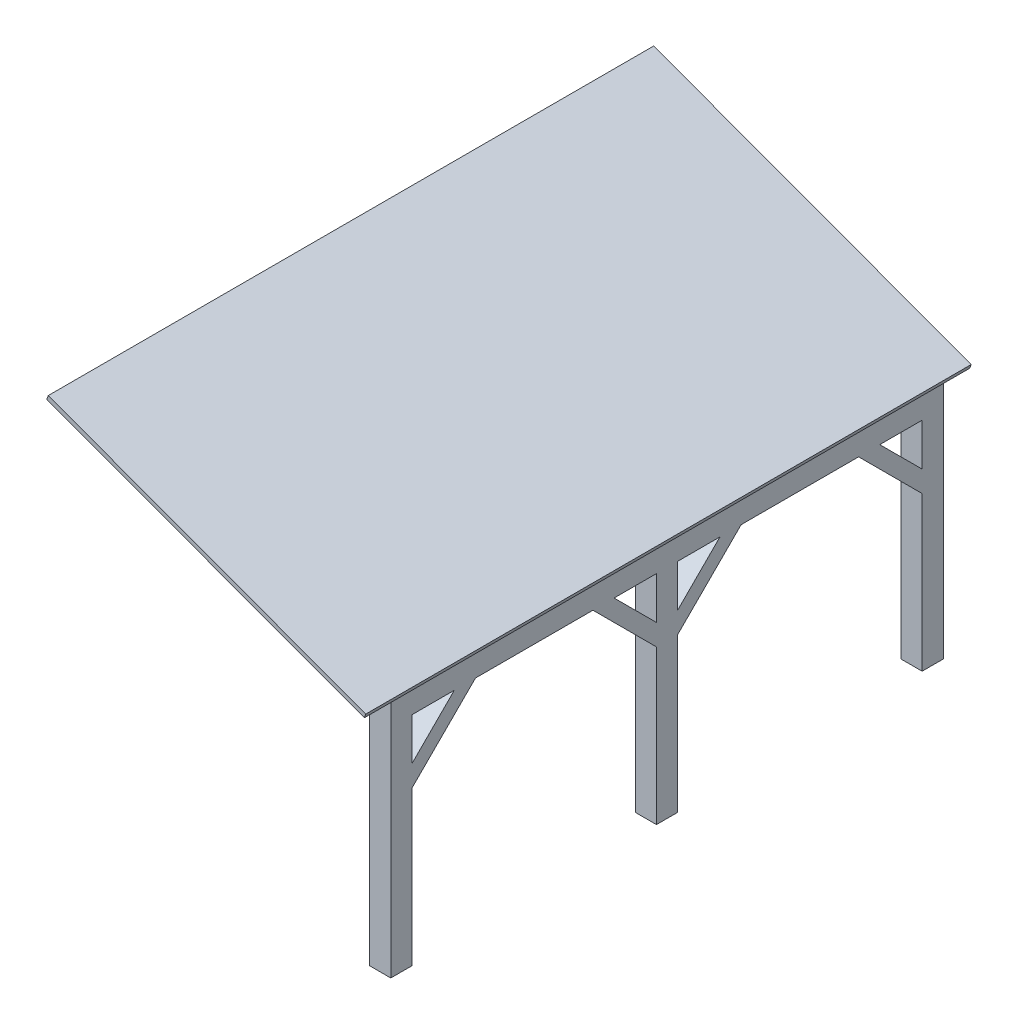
ISO-10303-21;
HEADER;
FILE_DESCRIPTION(('STEP AP214'),'2;1');
FILE_NAME('part.step','',(''),(''),'','','');
FILE_SCHEMA(('AUTOMOTIVE_DESIGN { 1 0 10303 214 1 1 1 1 }'));
ENDSEC;
DATA;
#1=APPLICATION_CONTEXT('core data for automotive mechanical design processes');
#2=APPLICATION_PROTOCOL_DEFINITION('international standard','automotive_design',2000,#1);
#3=PRODUCT_CONTEXT('',#1,'mechanical');
#4=PRODUCT('Part','Part','',(#3));
#5=PRODUCT_RELATED_PRODUCT_CATEGORY('part','',(#4));
#6=PRODUCT_DEFINITION_FORMATION('','',#4);
#7=PRODUCT_DEFINITION_CONTEXT('part definition',#1,'design');
#8=PRODUCT_DEFINITION('design','',#6,#7);
#9=PRODUCT_DEFINITION_SHAPE('','',#8);
#10=(LENGTH_UNIT() NAMED_UNIT(*) SI_UNIT(.MILLI.,.METRE.));
#11=(NAMED_UNIT(*) PLANE_ANGLE_UNIT() SI_UNIT($,.RADIAN.));
#12=(NAMED_UNIT(*) SI_UNIT($,.STERADIAN.) SOLID_ANGLE_UNIT());
#13=UNCERTAINTY_MEASURE_WITH_UNIT(LENGTH_MEASURE(1.E-05),#10,'distance_accuracy_value','');
#14=(GEOMETRIC_REPRESENTATION_CONTEXT(3) GLOBAL_UNCERTAINTY_ASSIGNED_CONTEXT((#13)) GLOBAL_UNIT_ASSIGNED_CONTEXT((#10,
#11,#12)) REPRESENTATION_CONTEXT('',''));
#15=CARTESIAN_POINT('',(0.,0.,0.));
#16=DIRECTION('',(0.,0.,1.));
#17=DIRECTION('',(1.,0.,0.));
#18=AXIS2_PLACEMENT_3D('',#15,#16,#17);
#19=CARTESIAN_POINT('',(0.,0.,26.1));
#20=DIRECTION('',(0.,0.,-1.));
#21=DIRECTION('',(-1.,0.,0.));
#22=AXIS2_PLACEMENT_3D('',#19,#20,#21);
#23=PLANE('',#22);
#24=DIRECTION('',(0.938268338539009,-0.345908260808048,0.));
#25=VECTOR('',#24,1.);
#26=CARTESIAN_POINT('',(15.,11.27,26.1));
#27=LINE('',#26,#25);
#28=CARTESIAN_POINT('',(0.,16.8,26.1));
#29=VERTEX_POINT('',#28);
#30=CARTESIAN_POINT('',(15.,11.27,26.1));
#31=VERTEX_POINT('',#30);
#32=EDGE_CURVE('E289',#29,#31,#27,.T.);
#33=ORIENTED_EDGE('',*,*,#32,.F.);
#34=DIRECTION('',(0.,-1.,0.));
#35=VECTOR('',#34,1.);
#36=CARTESIAN_POINT('',(0.,0.,26.1));
#37=LINE('',#36,#35);
#38=CARTESIAN_POINT('',(0.,15.7354198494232,26.1));
#39=VERTEX_POINT('',#38);
#40=EDGE_CURVE('E534',#29,#39,#37,.T.);
#41=ORIENTED_EDGE('',*,*,#40,.T.);
#42=DIRECTION('',(-0.937898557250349,0.346909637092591,0.));
#43=VECTOR('',#42,1.);
#44=CARTESIAN_POINT('',(0.,15.7354198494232,26.1));
#45=LINE('',#44,#43);
#46=CARTESIAN_POINT('',(1.,15.3655401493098,26.1));
#47=VERTEX_POINT('',#46);
#48=EDGE_CURVE('E489',#47,#39,#45,.T.);
#49=ORIENTED_EDGE('',*,*,#48,.F.);
#50=DIRECTION('',(-0.938268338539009,0.345908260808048,0.));
#51=VECTOR('',#50,1.);
#52=CARTESIAN_POINT('',(5.10661186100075,13.8515692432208,26.1));
#53=LINE('',#52,#51);
#54=CARTESIAN_POINT('',(14.,10.5728734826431,26.1));
#55=VERTEX_POINT('',#54);
#56=EDGE_CURVE('E524',#55,#47,#53,.T.);
#57=ORIENTED_EDGE('',*,*,#56,.F.);
#58=DIRECTION('',(0.,1.,0.));
#59=VECTOR('',#58,1.);
#60=CARTESIAN_POINT('',(14.,0.,26.1));
#61=LINE('',#60,#59);
#62=CARTESIAN_POINT('',(14.,0.,26.1));
#63=VERTEX_POINT('',#62);
#64=EDGE_CURVE('E516',#63,#55,#61,.T.);
#65=ORIENTED_EDGE('',*,*,#64,.F.);
#66=DIRECTION('',(1.,0.,0.));
#67=VECTOR('',#66,1.);
#68=CARTESIAN_POINT('',(15.,0.,26.1));
#69=LINE('',#68,#67);
#70=CARTESIAN_POINT('',(15.,0.,26.1));
#71=VERTEX_POINT('',#70);
#72=EDGE_CURVE('E528',#63,#71,#69,.T.);
#73=ORIENTED_EDGE('',*,*,#72,.T.);
#74=DIRECTION('',(0.,1.,0.));
#75=VECTOR('',#74,1.);
#76=CARTESIAN_POINT('',(15.,11.27,26.1));
#77=LINE('',#76,#75);
#78=EDGE_CURVE('E530',#71,#31,#77,.T.);
#79=ORIENTED_EDGE('',*,*,#78,.T.);
#80=EDGE_LOOP('',(#33,#41,#49,#57,#65,#73,#79));
#81=FACE_BOUND('',#80,.T.);
#82=ADVANCED_FACE('F31',(#81),#23,.F.);
#83=CARTESIAN_POINT('',(15.,0.,26.1));
#84=DIRECTION('',(0.,1.,0.));
#85=DIRECTION('',(-1.,0.,0.));
#86=AXIS2_PLACEMENT_3D('',#83,#84,#85);
#87=PLANE('',#86);
#88=DIRECTION('',(0.,0.,-1.));
#89=VECTOR('',#88,1.);
#90=CARTESIAN_POINT('',(14.,0.,26.1));
#91=LINE('',#90,#89);
#92=CARTESIAN_POINT('',(14.,0.,13.55));
#93=VERTEX_POINT('',#92);
#94=CARTESIAN_POINT('',(14.,0.,12.55));
#95=VERTEX_POINT('',#94);
#96=EDGE_CURVE('E517',#93,#95,#91,.T.);
#97=ORIENTED_EDGE('',*,*,#96,.T.);
#98=DIRECTION('',(1.,0.,0.));
#99=VECTOR('',#98,1.);
#100=CARTESIAN_POINT('',(14.,0.,12.55));
#101=LINE('',#100,#99);
#102=CARTESIAN_POINT('',(15.,0.,12.55));
#103=VERTEX_POINT('',#102);
#104=EDGE_CURVE('E444',#95,#103,#101,.T.);
#105=ORIENTED_EDGE('',*,*,#104,.T.);
#106=DIRECTION('',(0.,0.,-1.));
#107=VECTOR('',#106,1.);
#108=CARTESIAN_POINT('',(15.,0.,26.1));
#109=LINE('',#108,#107);
#110=CARTESIAN_POINT('',(15.,0.,13.55));
#111=VERTEX_POINT('',#110);
#112=EDGE_CURVE('E39',#111,#103,#109,.T.);
#113=ORIENTED_EDGE('',*,*,#112,.F.);
#114=DIRECTION('',(1.,0.,0.));
#115=VECTOR('',#114,1.);
#116=CARTESIAN_POINT('',(14.,0.,13.55));
#117=LINE('',#116,#115);
#118=EDGE_CURVE('E473',#93,#111,#117,.T.);
#119=ORIENTED_EDGE('',*,*,#118,.F.);
#120=EDGE_LOOP('',(#97,#105,#113,#119));
#121=FACE_BOUND('',#120,.T.);
#122=ADVANCED_FACE('F563',(#121),#87,.F.);
#123=CARTESIAN_POINT('',(14.,0.,25.1));
#124=VERTEX_POINT('',#123);
#125=EDGE_CURVE('E513',#63,#124,#91,.T.);
#126=ORIENTED_EDGE('',*,*,#125,.T.);
#127=DIRECTION('',(1.,0.,0.));
#128=VECTOR('',#127,1.);
#129=CARTESIAN_POINT('',(14.,0.,25.1));
#130=LINE('',#129,#128);
#131=CARTESIAN_POINT('',(15.,0.,25.1));
#132=VERTEX_POINT('',#131);
#133=EDGE_CURVE('E486',#124,#132,#130,.T.);
#134=ORIENTED_EDGE('',*,*,#133,.T.);
#135=EDGE_CURVE('E11',#71,#132,#109,.T.);
#136=ORIENTED_EDGE('',*,*,#135,.F.);
#137=ORIENTED_EDGE('',*,*,#72,.F.);
#138=EDGE_LOOP('',(#126,#134,#136,#137));
#139=FACE_BOUND('',#138,.T.);
#140=ADVANCED_FACE('F639',(#139),#87,.F.);
#141=CARTESIAN_POINT('',(15.,0.,0.999999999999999));
#142=VERTEX_POINT('',#141);
#143=CARTESIAN_POINT('',(15.,0.,0.));
#144=VERTEX_POINT('',#143);
#145=EDGE_CURVE('E40',#142,#144,#109,.T.);
#146=ORIENTED_EDGE('',*,*,#145,.F.);
#147=DIRECTION('',(1.,0.,0.));
#148=VECTOR('',#147,1.);
#149=CARTESIAN_POINT('',(14.,0.,0.999999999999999));
#150=LINE('',#149,#148);
#151=CARTESIAN_POINT('',(14.,0.,0.999999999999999));
#152=VERTEX_POINT('',#151);
#153=EDGE_CURVE('E431',#152,#142,#150,.T.);
#154=ORIENTED_EDGE('',*,*,#153,.F.);
#155=CARTESIAN_POINT('',(14.,0.,0.));
#156=VERTEX_POINT('',#155);
#157=EDGE_CURVE('E512',#152,#156,#91,.T.);
#158=ORIENTED_EDGE('',*,*,#157,.T.);
#159=DIRECTION('',(1.,0.,0.));
#160=VECTOR('',#159,1.);
#161=CARTESIAN_POINT('',(15.,0.,0.));
#162=LINE('',#161,#160);
#163=EDGE_CURVE('E520',#156,#144,#162,.T.);
#164=ORIENTED_EDGE('',*,*,#163,.T.);
#165=EDGE_LOOP('',(#146,#154,#158,#164));
#166=FACE_BOUND('',#165,.T.);
#167=ADVANCED_FACE('F33',(#166),#87,.F.);
#168=CARTESIAN_POINT('',(15.,11.27,26.1));
#169=DIRECTION('',(-1.,0.,0.));
#170=DIRECTION('',(0.,-1.,0.));
#171=AXIS2_PLACEMENT_3D('',#168,#169,#170);
#172=PLANE('',#171);
#173=DIRECTION('',(0.,0.,1.));
#174=VECTOR('',#173,1.);
#175=CARTESIAN_POINT('',(15.,10.27,12.55));
#176=LINE('',#175,#174);
#177=CARTESIAN_POINT('',(15.,10.27,10.55));
#178=VERTEX_POINT('',#177);
#179=CARTESIAN_POINT('',(15.,10.27,12.55));
#180=VERTEX_POINT('',#179);
#181=EDGE_CURVE('E332',#178,#180,#176,.T.);
#182=ORIENTED_EDGE('',*,*,#181,.F.);
#183=DIRECTION('',(0.,0.707106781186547,-0.707106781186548));
#184=VECTOR('',#183,1.);
#185=CARTESIAN_POINT('',(15.,10.27,10.55));
#186=LINE('',#185,#184);
#187=CARTESIAN_POINT('',(15.,8.27,12.55));
#188=VERTEX_POINT('',#187);
#189=EDGE_CURVE('E47',#188,#178,#186,.T.);
#190=ORIENTED_EDGE('',*,*,#189,.F.);
#191=DIRECTION('',(0.,-1.,0.));
#192=VECTOR('',#191,1.);
#193=CARTESIAN_POINT('',(15.,8.27,12.55));
#194=LINE('',#193,#192);
#195=EDGE_CURVE('E326',#180,#188,#194,.T.);
#196=ORIENTED_EDGE('',*,*,#195,.F.);
#197=EDGE_LOOP('',(#182,#190,#196));
#198=FACE_BOUND('',#197,.T.);
#199=DIRECTION('',(0.,1.,0.));
#200=VECTOR('',#199,1.);
#201=CARTESIAN_POINT('',(15.,10.27,13.55));
#202=LINE('',#201,#200);
#203=CARTESIAN_POINT('',(15.,8.27,13.55));
#204=VERTEX_POINT('',#203);
#205=CARTESIAN_POINT('',(15.,10.27,13.55));
#206=VERTEX_POINT('',#205);
#207=EDGE_CURVE('E355',#204,#206,#202,.T.);
#208=ORIENTED_EDGE('',*,*,#207,.F.);
#209=DIRECTION('',(0.,-0.707106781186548,-0.707106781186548));
#210=VECTOR('',#209,1.);
#211=CARTESIAN_POINT('',(15.,8.27,13.55));
#212=LINE('',#211,#210);
#213=CARTESIAN_POINT('',(15.,10.27,15.55));
#214=VERTEX_POINT('',#213);
#215=EDGE_CURVE('E339',#214,#204,#212,.T.);
#216=ORIENTED_EDGE('',*,*,#215,.F.);
#217=DIRECTION('',(0.,0.,1.));
#218=VECTOR('',#217,1.);
#219=CARTESIAN_POINT('',(15.,10.27,15.55));
#220=LINE('',#219,#218);
#221=EDGE_CURVE('E347',#206,#214,#220,.T.);
#222=ORIENTED_EDGE('',*,*,#221,.F.);
#223=EDGE_LOOP('',(#208,#216,#222));
#224=FACE_BOUND('',#223,.T.);
#225=DIRECTION('',(0.,1.,0.));
#226=VECTOR('',#225,1.);
#227=CARTESIAN_POINT('',(15.,10.27,1.));
#228=LINE('',#227,#226);
#229=CARTESIAN_POINT('',(15.,8.26999999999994,1.));
#230=VERTEX_POINT('',#229);
#231=CARTESIAN_POINT('',(15.,10.27,1.));
#232=VERTEX_POINT('',#231);
#233=EDGE_CURVE('E379',#230,#232,#228,.T.);
#234=ORIENTED_EDGE('',*,*,#233,.F.);
#235=DIRECTION('',(0.,-0.707106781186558,-0.707106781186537));
#236=VECTOR('',#235,1.);
#237=CARTESIAN_POINT('',(15.,8.26999999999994,1.));
#238=LINE('',#237,#236);
#239=CARTESIAN_POINT('',(15.,10.27,3.));
#240=VERTEX_POINT('',#239);
#241=EDGE_CURVE('E362',#240,#230,#238,.T.);
#242=ORIENTED_EDGE('',*,*,#241,.F.);
#243=DIRECTION('',(0.,0.,1.));
#244=VECTOR('',#243,1.);
#245=CARTESIAN_POINT('',(15.,10.27,3.));
#246=LINE('',#245,#244);
#247=EDGE_CURVE('E371',#232,#240,#246,.T.);
#248=ORIENTED_EDGE('',*,*,#247,.F.);
#249=EDGE_LOOP('',(#234,#242,#248));
#250=FACE_BOUND('',#249,.T.);
#251=DIRECTION('',(0.,0.707106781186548,-0.707106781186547));
#252=VECTOR('',#251,1.);
#253=CARTESIAN_POINT('',(15.,10.27,23.1));
#254=LINE('',#253,#252);
#255=CARTESIAN_POINT('',(15.,8.27,25.1));
#256=VERTEX_POINT('',#255);
#257=CARTESIAN_POINT('',(15.,10.27,23.1));
#258=VERTEX_POINT('',#257);
#259=EDGE_CURVE('E403',#256,#258,#254,.T.);
#260=ORIENTED_EDGE('',*,*,#259,.F.);
#261=DIRECTION('',(0.,-1.,0.));
#262=VECTOR('',#261,1.);
#263=CARTESIAN_POINT('',(15.,8.27,25.1));
#264=LINE('',#263,#262);
#265=CARTESIAN_POINT('',(15.,10.27,25.1));
#266=VERTEX_POINT('',#265);
#267=EDGE_CURVE('E386',#266,#256,#264,.T.);
#268=ORIENTED_EDGE('',*,*,#267,.F.);
#269=DIRECTION('',(0.,0.,1.));
#270=VECTOR('',#269,1.);
#271=CARTESIAN_POINT('',(15.,10.27,25.1));
#272=LINE('',#271,#270);
#273=EDGE_CURVE('E395',#258,#266,#272,.T.);
#274=ORIENTED_EDGE('',*,*,#273,.F.);
#275=EDGE_LOOP('',(#260,#268,#274));
#276=FACE_BOUND('',#275,.T.);
#277=ORIENTED_EDGE('',*,*,#112,.T.);
#278=DIRECTION('',(0.,-1.,0.));
#279=VECTOR('',#278,1.);
#280=CARTESIAN_POINT('',(15.,-16.6191971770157,12.55));
#281=LINE('',#280,#279);
#282=CARTESIAN_POINT('',(15.,7.27,12.55));
#283=VERTEX_POINT('',#282);
#284=EDGE_CURVE('E419',#283,#103,#281,.T.);
#285=ORIENTED_EDGE('',*,*,#284,.F.);
#286=DIRECTION('',(0.,-0.707106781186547,0.707106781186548));
#287=VECTOR('',#286,1.);
#288=CARTESIAN_POINT('',(15.,-4.92459858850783,24.7445985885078));
#289=LINE('',#288,#287);
#290=CARTESIAN_POINT('',(15.,10.27,9.55000000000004));
#291=VERTEX_POINT('',#290);
#292=EDGE_CURVE('E440',#291,#283,#289,.T.);
#293=ORIENTED_EDGE('',*,*,#292,.F.);
#294=DIRECTION('',(0.,0.,1.));
#295=VECTOR('',#294,1.);
#296=CARTESIAN_POINT('',(15.,10.27,13.05));
#297=LINE('',#296,#295);
#298=CARTESIAN_POINT('',(15.,10.27,4.));
#299=VERTEX_POINT('',#298);
#300=EDGE_CURVE('E437',#299,#291,#297,.T.);
#301=ORIENTED_EDGE('',*,*,#300,.F.);
#302=DIRECTION('',(0.,0.70710678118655,0.707106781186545));
#303=VECTOR('',#302,1.);
#304=CARTESIAN_POINT('',(15.,1.35040141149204,-4.91959858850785));
#305=LINE('',#304,#303);
#306=CARTESIAN_POINT('',(15.,7.26999999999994,1.00000000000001));
#307=VERTEX_POINT('',#306);
#308=EDGE_CURVE('E434',#307,#299,#305,.T.);
#309=ORIENTED_EDGE('',*,*,#308,.F.);
#310=DIRECTION('',(0.,1.,0.));
#311=VECTOR('',#310,1.);
#312=CARTESIAN_POINT('',(15.,-16.6191971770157,0.999999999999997));
#313=LINE('',#312,#311);
#314=EDGE_CURVE('E410',#142,#307,#313,.T.);
#315=ORIENTED_EDGE('',*,*,#314,.F.);
#316=ORIENTED_EDGE('',*,*,#145,.T.);
#317=DIRECTION('',(0.,1.,0.));
#318=VECTOR('',#317,1.);
#319=CARTESIAN_POINT('',(15.,11.27,0.));
#320=LINE('',#319,#318);
#321=CARTESIAN_POINT('',(15.,11.27,0.));
#322=VERTEX_POINT('',#321);
#323=EDGE_CURVE('E540',#144,#322,#320,.T.);
#324=ORIENTED_EDGE('',*,*,#323,.T.);
#325=DIRECTION('',(0.,0.,-1.));
#326=VECTOR('',#325,1.);
#327=CARTESIAN_POINT('',(15.,11.27,26.1));
#328=LINE('',#327,#326);
#329=EDGE_CURVE('E546',#31,#322,#328,.T.);
#330=ORIENTED_EDGE('',*,*,#329,.F.);
#331=ORIENTED_EDGE('',*,*,#78,.F.);
#332=ORIENTED_EDGE('',*,*,#135,.T.);
#333=DIRECTION('',(0.,-1.,0.));
#334=VECTOR('',#333,1.);
#335=CARTESIAN_POINT('',(15.,-16.6191971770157,25.1));
#336=LINE('',#335,#334);
#337=CARTESIAN_POINT('',(15.,7.27,25.1));
#338=VERTEX_POINT('',#337);
#339=EDGE_CURVE('E461',#338,#132,#336,.T.);
#340=ORIENTED_EDGE('',*,*,#339,.F.);
#341=DIRECTION('',(0.,-0.707106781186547,0.707106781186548));
#342=VECTOR('',#341,1.);
#343=CARTESIAN_POINT('',(15.,1.35040141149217,31.0195985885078));
#344=LINE('',#343,#342);
#345=CARTESIAN_POINT('',(15.,10.27,22.1));
#346=VERTEX_POINT('',#345);
#347=EDGE_CURVE('E482',#346,#338,#344,.T.);
#348=ORIENTED_EDGE('',*,*,#347,.F.);
#349=DIRECTION('',(0.,0.,1.));
#350=VECTOR('',#349,1.);
#351=CARTESIAN_POINT('',(15.,10.27,13.05));
#352=LINE('',#351,#350);
#353=CARTESIAN_POINT('',(15.,10.27,16.55));
#354=VERTEX_POINT('',#353);
#355=EDGE_CURVE('E479',#354,#346,#352,.T.);
#356=ORIENTED_EDGE('',*,*,#355,.F.);
#357=DIRECTION('',(0.,0.707106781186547,0.707106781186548));
#358=VECTOR('',#357,1.);
#359=CARTESIAN_POINT('',(15.,-4.92459858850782,1.35540141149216));
#360=LINE('',#359,#358);
#361=CARTESIAN_POINT('',(15.,7.27,13.55));
#362=VERTEX_POINT('',#361);
#363=EDGE_CURVE('E476',#362,#354,#360,.T.);
#364=ORIENTED_EDGE('',*,*,#363,.F.);
#365=DIRECTION('',(0.,1.,0.));
#366=VECTOR('',#365,1.);
#367=CARTESIAN_POINT('',(15.,-16.6191971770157,13.55));
#368=LINE('',#367,#366);
#369=EDGE_CURVE('E447',#111,#362,#368,.T.);
#370=ORIENTED_EDGE('',*,*,#369,.F.);
#371=EDGE_LOOP('',(#277,#285,#293,#301,#309,#315,#316,#324,#330,#331,#332,#340,#348,#356,#364,#370));
#372=FACE_BOUND('',#371,.T.);
#373=ADVANCED_FACE('F557',(#198,#224,#250,#276,#372),#172,.F.);
#374=CARTESIAN_POINT('',(0.,0.,26.1));
#375=DIRECTION('',(1.,0.,0.));
#376=DIRECTION('',(0.,0.,-1.));
#377=AXIS2_PLACEMENT_3D('',#374,#375,#376);
#378=PLANE('',#377);
#379=DIRECTION('',(0.,-1.,0.));
#380=VECTOR('',#379,1.);
#381=CARTESIAN_POINT('',(0.,0.,0.));
#382=LINE('',#381,#380);
#383=CARTESIAN_POINT('',(0.,16.8,0.));
#384=VERTEX_POINT('',#383);
#385=CARTESIAN_POINT('',(0.,15.7354198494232,0.));
#386=VERTEX_POINT('',#385);
#387=EDGE_CURVE('E531',#384,#386,#382,.T.);
#388=ORIENTED_EDGE('',*,*,#387,.T.);
#389=DIRECTION('',(0.,0.,1.));
#390=VECTOR('',#389,1.);
#391=CARTESIAN_POINT('',(0.,15.7354198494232,0.));
#392=LINE('',#391,#390);
#393=EDGE_CURVE('E502',#386,#39,#392,.T.);
#394=ORIENTED_EDGE('',*,*,#393,.T.);
#395=ORIENTED_EDGE('',*,*,#40,.F.);
#396=DIRECTION('',(0.,0.,-1.));
#397=VECTOR('',#396,1.);
#398=CARTESIAN_POINT('',(0.,16.8,26.1));
#399=LINE('',#398,#397);
#400=EDGE_CURVE('E537',#29,#384,#399,.T.);
#401=ORIENTED_EDGE('',*,*,#400,.T.);
#402=EDGE_LOOP('',(#388,#394,#395,#401));
#403=FACE_BOUND('',#402,.T.);
#404=ADVANCED_FACE('F611',(#403),#378,.F.);
#405=CARTESIAN_POINT('',(0.,0.,0.));
#406=DIRECTION('',(0.,0.,-1.));
#407=DIRECTION('',(-1.,0.,0.));
#408=AXIS2_PLACEMENT_3D('',#405,#406,#407);
#409=PLANE('',#408);
#410=DIRECTION('',(0.,1.,0.));
#411=VECTOR('',#410,1.);
#412=CARTESIAN_POINT('',(0.0691816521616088,16.7744950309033,0.));
#413=LINE('',#412,#411);
#414=CARTESIAN_POINT('',(0.0691816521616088,16.7744950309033,0.));
#415=VERTEX_POINT('',#414);
#416=CARTESIAN_POINT('',(0.0691816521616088,16.9876536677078,0.));
#417=VERTEX_POINT('',#416);
#418=EDGE_CURVE('E288',#415,#417,#413,.T.);
#419=ORIENTED_EDGE('',*,*,#418,.F.);
#420=DIRECTION('',(-0.938268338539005,0.345908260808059,0.));
#421=VECTOR('',#420,1.);
#422=CARTESIAN_POINT('',(15.,11.27,0.));
#423=LINE('',#422,#421);
#424=EDGE_CURVE('E285',#322,#415,#423,.T.);
#425=ORIENTED_EDGE('',*,*,#424,.F.);
#426=ORIENTED_EDGE('',*,*,#323,.F.);
#427=ORIENTED_EDGE('',*,*,#163,.F.);
#428=DIRECTION('',(0.,1.,0.));
#429=VECTOR('',#428,1.);
#430=CARTESIAN_POINT('',(14.,-25.1,0.));
#431=LINE('',#430,#429);
#432=CARTESIAN_POINT('',(14.,10.5728734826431,0.));
#433=VERTEX_POINT('',#432);
#434=EDGE_CURVE('E509',#156,#433,#431,.T.);
#435=ORIENTED_EDGE('',*,*,#434,.T.);
#436=DIRECTION('',(0.938268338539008,-0.345908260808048,0.));
#437=VECTOR('',#436,1.);
#438=CARTESIAN_POINT('',(5.10661186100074,13.8515692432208,0.));
#439=LINE('',#438,#437);
#440=CARTESIAN_POINT('',(1.,15.3655401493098,0.));
#441=VERTEX_POINT('',#440);
#442=EDGE_CURVE('E506',#441,#433,#439,.T.);
#443=ORIENTED_EDGE('',*,*,#442,.F.);
#444=DIRECTION('',(-0.937898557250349,0.346909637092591,0.));
#445=VECTOR('',#444,1.);
#446=CARTESIAN_POINT('',(0.,15.7354198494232,0.));
#447=LINE('',#446,#445);
#448=EDGE_CURVE('E499',#441,#386,#447,.T.);
#449=ORIENTED_EDGE('',*,*,#448,.T.);
#450=ORIENTED_EDGE('',*,*,#387,.F.);
#451=DIRECTION('',(-0.345908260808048,-0.938268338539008,0.));
#452=VECTOR('',#451,1.);
#453=CARTESIAN_POINT('',(0.0691816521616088,16.9876536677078,0.));
#454=LINE('',#453,#452);
#455=EDGE_CURVE('E319',#417,#384,#454,.T.);
#456=ORIENTED_EDGE('',*,*,#455,.F.);
#457=EDGE_LOOP('',(#419,#425,#426,#427,#435,#443,#449,#450,#456));
#458=FACE_BOUND('',#457,.T.);
#459=ADVANCED_FACE('F590',(#458),#409,.T.);
#460=CARTESIAN_POINT('',(14.,11.27,26.1));
#461=DIRECTION('',(-1.,0.,0.));
#462=DIRECTION('',(0.,-1.,0.));
#463=AXIS2_PLACEMENT_3D('',#460,#461,#462);
#464=PLANE('',#463);
#465=DIRECTION('',(0.,0.707106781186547,-0.707106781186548));
#466=VECTOR('',#465,1.);
#467=CARTESIAN_POINT('',(14.,10.27,10.55));
#468=LINE('',#467,#466);
#469=CARTESIAN_POINT('',(14.,8.27,12.55));
#470=VERTEX_POINT('',#469);
#471=CARTESIAN_POINT('',(14.,10.27,10.55));
#472=VERTEX_POINT('',#471);
#473=EDGE_CURVE('E322',#470,#472,#468,.T.);
#474=ORIENTED_EDGE('',*,*,#473,.T.);
#475=DIRECTION('',(0.,0.,1.));
#476=VECTOR('',#475,1.);
#477=CARTESIAN_POINT('',(14.,10.27,12.55));
#478=LINE('',#477,#476);
#479=CARTESIAN_POINT('',(14.,10.27,12.55));
#480=VERTEX_POINT('',#479);
#481=EDGE_CURVE('E325',#472,#480,#478,.T.);
#482=ORIENTED_EDGE('',*,*,#481,.T.);
#483=DIRECTION('',(0.,-1.,0.));
#484=VECTOR('',#483,1.);
#485=CARTESIAN_POINT('',(14.,8.27,12.55));
#486=LINE('',#485,#484);
#487=EDGE_CURVE('E55',#480,#470,#486,.T.);
#488=ORIENTED_EDGE('',*,*,#487,.T.);
#489=EDGE_LOOP('',(#474,#482,#488));
#490=FACE_BOUND('',#489,.T.);
#491=DIRECTION('',(0.,-0.707106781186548,-0.707106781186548));
#492=VECTOR('',#491,1.);
#493=CARTESIAN_POINT('',(14.,8.27,13.55));
#494=LINE('',#493,#492);
#495=CARTESIAN_POINT('',(14.,10.27,15.55));
#496=VERTEX_POINT('',#495);
#497=CARTESIAN_POINT('',(14.,8.27,13.55));
#498=VERTEX_POINT('',#497);
#499=EDGE_CURVE('E343',#496,#498,#494,.T.);
#500=ORIENTED_EDGE('',*,*,#499,.T.);
#501=DIRECTION('',(0.,1.,0.));
#502=VECTOR('',#501,1.);
#503=CARTESIAN_POINT('',(14.,10.27,13.55));
#504=LINE('',#503,#502);
#505=CARTESIAN_POINT('',(14.,10.27,13.55));
#506=VERTEX_POINT('',#505);
#507=EDGE_CURVE('E346',#498,#506,#504,.T.);
#508=ORIENTED_EDGE('',*,*,#507,.T.);
#509=DIRECTION('',(0.,0.,1.));
#510=VECTOR('',#509,1.);
#511=CARTESIAN_POINT('',(14.,10.27,15.55));
#512=LINE('',#511,#510);
#513=EDGE_CURVE('E350',#506,#496,#512,.T.);
#514=ORIENTED_EDGE('',*,*,#513,.T.);
#515=EDGE_LOOP('',(#500,#508,#514));
#516=FACE_BOUND('',#515,.T.);
#517=DIRECTION('',(0.,-0.707106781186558,-0.707106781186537));
#518=VECTOR('',#517,1.);
#519=CARTESIAN_POINT('',(14.,8.26999999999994,1.));
#520=LINE('',#519,#518);
#521=CARTESIAN_POINT('',(14.,10.27,3.));
#522=VERTEX_POINT('',#521);
#523=CARTESIAN_POINT('',(14.,8.26999999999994,1.));
#524=VERTEX_POINT('',#523);
#525=EDGE_CURVE('E367',#522,#524,#520,.T.);
#526=ORIENTED_EDGE('',*,*,#525,.T.);
#527=DIRECTION('',(0.,1.,0.));
#528=VECTOR('',#527,1.);
#529=CARTESIAN_POINT('',(14.,10.27,1.));
#530=LINE('',#529,#528);
#531=CARTESIAN_POINT('',(14.,10.27,1.));
#532=VERTEX_POINT('',#531);
#533=EDGE_CURVE('E370',#524,#532,#530,.T.);
#534=ORIENTED_EDGE('',*,*,#533,.T.);
#535=DIRECTION('',(0.,0.,1.));
#536=VECTOR('',#535,1.);
#537=CARTESIAN_POINT('',(14.,10.27,3.));
#538=LINE('',#537,#536);
#539=EDGE_CURVE('E374',#532,#522,#538,.T.);
#540=ORIENTED_EDGE('',*,*,#539,.T.);
#541=EDGE_LOOP('',(#526,#534,#540));
#542=FACE_BOUND('',#541,.T.);
#543=DIRECTION('',(0.,-1.,0.));
#544=VECTOR('',#543,1.);
#545=CARTESIAN_POINT('',(14.,8.27,25.1));
#546=LINE('',#545,#544);
#547=CARTESIAN_POINT('',(14.,10.27,25.1));
#548=VERTEX_POINT('',#547);
#549=CARTESIAN_POINT('',(14.,8.27,25.1));
#550=VERTEX_POINT('',#549);
#551=EDGE_CURVE('E391',#548,#550,#546,.T.);
#552=ORIENTED_EDGE('',*,*,#551,.T.);
#553=DIRECTION('',(0.,0.707106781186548,-0.707106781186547));
#554=VECTOR('',#553,1.);
#555=CARTESIAN_POINT('',(14.,10.27,23.1));
#556=LINE('',#555,#554);
#557=CARTESIAN_POINT('',(14.,10.27,23.1));
#558=VERTEX_POINT('',#557);
#559=EDGE_CURVE('E394',#550,#558,#556,.T.);
#560=ORIENTED_EDGE('',*,*,#559,.T.);
#561=DIRECTION('',(0.,0.,1.));
#562=VECTOR('',#561,1.);
#563=CARTESIAN_POINT('',(14.,10.27,25.1));
#564=LINE('',#563,#562);
#565=EDGE_CURVE('E398',#558,#548,#564,.T.);
#566=ORIENTED_EDGE('',*,*,#565,.T.);
#567=EDGE_LOOP('',(#552,#560,#566));
#568=FACE_BOUND('',#567,.T.);
#569=DIRECTION('',(0.,-1.,0.));
#570=VECTOR('',#569,1.);
#571=CARTESIAN_POINT('',(14.,-16.6191971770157,12.55));
#572=LINE('',#571,#570);
#573=CARTESIAN_POINT('',(14.,7.27,12.55));
#574=VERTEX_POINT('',#573);
#575=EDGE_CURVE('E428',#574,#95,#572,.T.);
#576=ORIENTED_EDGE('',*,*,#575,.T.);
#577=ORIENTED_EDGE('',*,*,#96,.F.);
#578=DIRECTION('',(0.,1.,0.));
#579=VECTOR('',#578,1.);
#580=CARTESIAN_POINT('',(14.,-16.6191971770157,13.55));
#581=LINE('',#580,#579);
#582=CARTESIAN_POINT('',(14.,7.27,13.55));
#583=VERTEX_POINT('',#582);
#584=EDGE_CURVE('E457',#93,#583,#581,.T.);
#585=ORIENTED_EDGE('',*,*,#584,.T.);
#586=DIRECTION('',(0.,0.707106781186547,0.707106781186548));
#587=VECTOR('',#586,1.);
#588=CARTESIAN_POINT('',(14.,-4.92459858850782,1.35540141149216));
#589=LINE('',#588,#587);
#590=CARTESIAN_POINT('',(14.,10.27,16.55));
#591=VERTEX_POINT('',#590);
#592=EDGE_CURVE('E460',#583,#591,#589,.T.);
#593=ORIENTED_EDGE('',*,*,#592,.T.);
#594=DIRECTION('',(0.,0.,1.));
#595=VECTOR('',#594,1.);
#596=CARTESIAN_POINT('',(14.,10.27,13.05));
#597=LINE('',#596,#595);
#598=CARTESIAN_POINT('',(14.,10.27,22.1));
#599=VERTEX_POINT('',#598);
#600=EDGE_CURVE('E464',#591,#599,#597,.T.);
#601=ORIENTED_EDGE('',*,*,#600,.T.);
#602=DIRECTION('',(0.,-0.707106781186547,0.707106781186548));
#603=VECTOR('',#602,1.);
#604=CARTESIAN_POINT('',(14.,1.35040141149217,31.0195985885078));
#605=LINE('',#604,#603);
#606=CARTESIAN_POINT('',(14.,7.27,25.1));
#607=VERTEX_POINT('',#606);
#608=EDGE_CURVE('E467',#599,#607,#605,.T.);
#609=ORIENTED_EDGE('',*,*,#608,.T.);
#610=DIRECTION('',(0.,-1.,0.));
#611=VECTOR('',#610,1.);
#612=CARTESIAN_POINT('',(14.,-16.6191971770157,25.1));
#613=LINE('',#612,#611);
#614=EDGE_CURVE('E470',#607,#124,#613,.T.);
#615=ORIENTED_EDGE('',*,*,#614,.T.);
#616=ORIENTED_EDGE('',*,*,#125,.F.);
#617=ORIENTED_EDGE('',*,*,#64,.T.);
#618=DIRECTION('',(0.,0.,-1.));
#619=VECTOR('',#618,1.);
#620=CARTESIAN_POINT('',(14.,10.5728734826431,26.1));
#621=LINE('',#620,#619);
#622=EDGE_CURVE('E518',#55,#433,#621,.T.);
#623=ORIENTED_EDGE('',*,*,#622,.T.);
#624=ORIENTED_EDGE('',*,*,#434,.F.);
#625=ORIENTED_EDGE('',*,*,#157,.F.);
#626=DIRECTION('',(0.,1.,0.));
#627=VECTOR('',#626,1.);
#628=CARTESIAN_POINT('',(14.,-16.6191971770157,0.999999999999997));
#629=LINE('',#628,#627);
#630=CARTESIAN_POINT('',(14.,7.26999999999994,1.));
#631=VERTEX_POINT('',#630);
#632=EDGE_CURVE('E415',#152,#631,#629,.T.);
#633=ORIENTED_EDGE('',*,*,#632,.T.);
#634=DIRECTION('',(0.,0.70710678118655,0.707106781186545));
#635=VECTOR('',#634,1.);
#636=CARTESIAN_POINT('',(14.,1.35040141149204,-4.91959858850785));
#637=LINE('',#636,#635);
#638=CARTESIAN_POINT('',(14.,10.27,4.));
#639=VERTEX_POINT('',#638);
#640=EDGE_CURVE('E418',#631,#639,#637,.T.);
#641=ORIENTED_EDGE('',*,*,#640,.T.);
#642=DIRECTION('',(0.,0.,1.));
#643=VECTOR('',#642,1.);
#644=CARTESIAN_POINT('',(14.,10.27,13.05));
#645=LINE('',#644,#643);
#646=CARTESIAN_POINT('',(14.,10.27,9.55000000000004));
#647=VERTEX_POINT('',#646);
#648=EDGE_CURVE('E422',#639,#647,#645,.T.);
#649=ORIENTED_EDGE('',*,*,#648,.T.);
#650=DIRECTION('',(0.,-0.707106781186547,0.707106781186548));
#651=VECTOR('',#650,1.);
#652=CARTESIAN_POINT('',(14.,-4.92459858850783,24.7445985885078));
#653=LINE('',#652,#651);
#654=EDGE_CURVE('E425',#647,#574,#653,.T.);
#655=ORIENTED_EDGE('',*,*,#654,.T.);
#656=EDGE_LOOP('',(#576,#577,#585,#593,#601,#609,#615,#616,#617,#623,#624,#625,#633,#641,#649,#655));
#657=FACE_BOUND('',#656,.T.);
#658=ADVANCED_FACE('F569',(#490,#516,#542,#568,#657),#464,.T.);
#659=CARTESIAN_POINT('',(-0.345908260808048,15.861731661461,26.1));
#660=DIRECTION('',(-0.345908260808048,-0.938268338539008,0.));
#661=DIRECTION('',(0.938268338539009,-0.345908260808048,0.));
#662=AXIS2_PLACEMENT_3D('',#659,#660,#661);
#663=PLANE('',#662);
#664=DIRECTION('',(0.,0.,-1.));
#665=VECTOR('',#664,1.);
#666=CARTESIAN_POINT('',(1.,15.3655401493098,26.1));
#667=LINE('',#666,#665);
#668=EDGE_CURVE('E521',#47,#441,#667,.T.);
#669=ORIENTED_EDGE('',*,*,#668,.T.);
#670=ORIENTED_EDGE('',*,*,#442,.T.);
#671=ORIENTED_EDGE('',*,*,#622,.F.);
#672=ORIENTED_EDGE('',*,*,#56,.T.);
#673=EDGE_LOOP('',(#669,#670,#671,#672));
#674=FACE_BOUND('',#673,.T.);
#675=ADVANCED_FACE('F617',(#674),#663,.T.);
#676=CARTESIAN_POINT('',(0.,15.7354198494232,0.));
#677=DIRECTION('',(0.346909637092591,0.937898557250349,0.));
#678=DIRECTION('',(-0.937898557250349,0.346909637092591,0.));
#679=AXIS2_PLACEMENT_3D('',#676,#677,#678);
#680=PLANE('',#679);
#681=ORIENTED_EDGE('',*,*,#48,.T.);
#682=ORIENTED_EDGE('',*,*,#393,.F.);
#683=ORIENTED_EDGE('',*,*,#448,.F.);
#684=ORIENTED_EDGE('',*,*,#668,.F.);
#685=EDGE_LOOP('',(#681,#682,#683,#684));
#686=FACE_BOUND('',#685,.T.);
#687=ADVANCED_FACE('F620',(#686),#680,.F.);
#688=CARTESIAN_POINT('',(14.,-16.6191971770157,25.1));
#689=DIRECTION('',(0.,0.,1.));
#690=DIRECTION('',(1.,0.,0.));
#691=AXIS2_PLACEMENT_3D('',#688,#689,#690);
#692=PLANE('',#691);
#693=ORIENTED_EDGE('',*,*,#339,.T.);
#694=ORIENTED_EDGE('',*,*,#133,.F.);
#695=ORIENTED_EDGE('',*,*,#614,.F.);
#696=DIRECTION('',(1.,0.,0.));
#697=VECTOR('',#696,1.);
#698=CARTESIAN_POINT('',(14.,7.27,25.1));
#699=LINE('',#698,#697);
#700=EDGE_CURVE('E490',#607,#338,#699,.T.);
#701=ORIENTED_EDGE('',*,*,#700,.T.);
#702=EDGE_LOOP('',(#693,#694,#695,#701));
#703=FACE_BOUND('',#702,.T.);
#704=ADVANCED_FACE('F622',(#703),#692,.F.);
#705=CARTESIAN_POINT('',(14.,1.35040141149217,31.0195985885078));
#706=DIRECTION('',(0.,0.707106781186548,0.707106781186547));
#707=DIRECTION('',(0.,-0.707106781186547,0.707106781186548));
#708=AXIS2_PLACEMENT_3D('',#705,#706,#707);
#709=PLANE('',#708);
#710=ORIENTED_EDGE('',*,*,#347,.T.);
#711=ORIENTED_EDGE('',*,*,#700,.F.);
#712=ORIENTED_EDGE('',*,*,#608,.F.);
#713=DIRECTION('',(1.,0.,0.));
#714=VECTOR('',#713,1.);
#715=CARTESIAN_POINT('',(14.,10.27,22.1));
#716=LINE('',#715,#714);
#717=EDGE_CURVE('E492',#599,#346,#716,.T.);
#718=ORIENTED_EDGE('',*,*,#717,.T.);
#719=EDGE_LOOP('',(#710,#711,#712,#718));
#720=FACE_BOUND('',#719,.T.);
#721=ADVANCED_FACE('F628',(#720),#709,.F.);
#722=CARTESIAN_POINT('',(14.,10.27,13.05));
#723=DIRECTION('',(0.,1.,0.));
#724=DIRECTION('',(-1.,0.,0.));
#725=AXIS2_PLACEMENT_3D('',#722,#723,#724);
#726=PLANE('',#725);
#727=ORIENTED_EDGE('',*,*,#355,.T.);
#728=ORIENTED_EDGE('',*,*,#717,.F.);
#729=ORIENTED_EDGE('',*,*,#600,.F.);
#730=DIRECTION('',(1.,0.,0.));
#731=VECTOR('',#730,1.);
#732=CARTESIAN_POINT('',(14.,10.27,16.55));
#733=LINE('',#732,#731);
#734=EDGE_CURVE('E494',#591,#354,#733,.T.);
#735=ORIENTED_EDGE('',*,*,#734,.T.);
#736=EDGE_LOOP('',(#727,#728,#729,#735));
#737=FACE_BOUND('',#736,.T.);
#738=ADVANCED_FACE('F721',(#737),#726,.F.);
#739=CARTESIAN_POINT('',(14.,-4.92459858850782,1.35540141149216));
#740=DIRECTION('',(0.,0.707106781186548,-0.707106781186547));
#741=DIRECTION('',(0.,0.707106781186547,0.707106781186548));
#742=AXIS2_PLACEMENT_3D('',#739,#740,#741);
#743=PLANE('',#742);
#744=ORIENTED_EDGE('',*,*,#363,.T.);
#745=ORIENTED_EDGE('',*,*,#734,.F.);
#746=ORIENTED_EDGE('',*,*,#592,.F.);
#747=DIRECTION('',(1.,0.,0.));
#748=VECTOR('',#747,1.);
#749=CARTESIAN_POINT('',(14.,7.27,13.55));
#750=LINE('',#749,#748);
#751=EDGE_CURVE('E496',#583,#362,#750,.T.);
#752=ORIENTED_EDGE('',*,*,#751,.T.);
#753=EDGE_LOOP('',(#744,#745,#746,#752));
#754=FACE_BOUND('',#753,.T.);
#755=ADVANCED_FACE('F725',(#754),#743,.F.);
#756=CARTESIAN_POINT('',(14.,-16.6191971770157,13.55));
#757=DIRECTION('',(0.,0.,-1.));
#758=DIRECTION('',(0.,1.,0.));
#759=AXIS2_PLACEMENT_3D('',#756,#757,#758);
#760=PLANE('',#759);
#761=ORIENTED_EDGE('',*,*,#369,.T.);
#762=ORIENTED_EDGE('',*,*,#751,.F.);
#763=ORIENTED_EDGE('',*,*,#584,.F.);
#764=ORIENTED_EDGE('',*,*,#118,.T.);
#765=EDGE_LOOP('',(#761,#762,#763,#764));
#766=FACE_BOUND('',#765,.T.);
#767=ADVANCED_FACE('F710',(#766),#760,.F.);
#768=CARTESIAN_POINT('',(14.,-16.6191971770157,12.55));
#769=DIRECTION('',(0.,0.,1.));
#770=DIRECTION('',(1.,0.,0.));
#771=AXIS2_PLACEMENT_3D('',#768,#769,#770);
#772=PLANE('',#771);
#773=ORIENTED_EDGE('',*,*,#284,.T.);
#774=ORIENTED_EDGE('',*,*,#104,.F.);
#775=ORIENTED_EDGE('',*,*,#575,.F.);
#776=DIRECTION('',(1.,0.,0.));
#777=VECTOR('',#776,1.);
#778=CARTESIAN_POINT('',(14.,7.27,12.55));
#779=LINE('',#778,#777);
#780=EDGE_CURVE('E448',#574,#283,#779,.T.);
#781=ORIENTED_EDGE('',*,*,#780,.T.);
#782=EDGE_LOOP('',(#773,#774,#775,#781));
#783=FACE_BOUND('',#782,.T.);
#784=ADVANCED_FACE('F567',(#783),#772,.F.);
#785=CARTESIAN_POINT('',(14.,-4.92459858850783,24.7445985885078));
#786=DIRECTION('',(0.,0.707106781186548,0.707106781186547));
#787=DIRECTION('',(0.,-0.707106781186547,0.707106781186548));
#788=AXIS2_PLACEMENT_3D('',#785,#786,#787);
#789=PLANE('',#788);
#790=ORIENTED_EDGE('',*,*,#292,.T.);
#791=ORIENTED_EDGE('',*,*,#780,.F.);
#792=ORIENTED_EDGE('',*,*,#654,.F.);
#793=DIRECTION('',(1.,0.,0.));
#794=VECTOR('',#793,1.);
#795=CARTESIAN_POINT('',(14.,10.27,9.55000000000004));
#796=LINE('',#795,#794);
#797=EDGE_CURVE('E450',#647,#291,#796,.T.);
#798=ORIENTED_EDGE('',*,*,#797,.T.);
#799=EDGE_LOOP('',(#790,#791,#792,#798));
#800=FACE_BOUND('',#799,.T.);
#801=ADVANCED_FACE('F573',(#800),#789,.F.);
#802=CARTESIAN_POINT('',(14.,10.27,13.05));
#803=DIRECTION('',(0.,1.,0.));
#804=DIRECTION('',(-1.,0.,0.));
#805=AXIS2_PLACEMENT_3D('',#802,#803,#804);
#806=PLANE('',#805);
#807=ORIENTED_EDGE('',*,*,#300,.T.);
#808=ORIENTED_EDGE('',*,*,#797,.F.);
#809=ORIENTED_EDGE('',*,*,#648,.F.);
#810=DIRECTION('',(1.,0.,0.));
#811=VECTOR('',#810,1.);
#812=CARTESIAN_POINT('',(14.,10.27,4.));
#813=LINE('',#812,#811);
#814=EDGE_CURVE('E452',#639,#299,#813,.T.);
#815=ORIENTED_EDGE('',*,*,#814,.T.);
#816=EDGE_LOOP('',(#807,#808,#809,#815));
#817=FACE_BOUND('',#816,.T.);
#818=ADVANCED_FACE('F577',(#817),#806,.F.);
#819=CARTESIAN_POINT('',(14.,1.35040141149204,-4.91959858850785));
#820=DIRECTION('',(0.,0.707106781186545,-0.70710678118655));
#821=DIRECTION('',(0.,0.70710678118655,0.707106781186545));
#822=AXIS2_PLACEMENT_3D('',#819,#820,#821);
#823=PLANE('',#822);
#824=ORIENTED_EDGE('',*,*,#308,.T.);
#825=ORIENTED_EDGE('',*,*,#814,.F.);
#826=ORIENTED_EDGE('',*,*,#640,.F.);
#827=DIRECTION('',(1.,0.,0.));
#828=VECTOR('',#827,1.);
#829=CARTESIAN_POINT('',(14.,7.26999999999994,1.00000000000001));
#830=LINE('',#829,#828);
#831=EDGE_CURVE('E454',#631,#307,#830,.T.);
#832=ORIENTED_EDGE('',*,*,#831,.T.);
#833=EDGE_LOOP('',(#824,#825,#826,#832));
#834=FACE_BOUND('',#833,.T.);
#835=ADVANCED_FACE('F579',(#834),#823,.F.);
#836=CARTESIAN_POINT('',(14.,-16.6191971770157,0.999999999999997));
#837=DIRECTION('',(0.,0.,-1.));
#838=DIRECTION('',(0.,1.,0.));
#839=AXIS2_PLACEMENT_3D('',#836,#837,#838);
#840=PLANE('',#839);
#841=ORIENTED_EDGE('',*,*,#314,.T.);
#842=ORIENTED_EDGE('',*,*,#831,.F.);
#843=ORIENTED_EDGE('',*,*,#632,.F.);
#844=ORIENTED_EDGE('',*,*,#153,.T.);
#845=EDGE_LOOP('',(#841,#842,#843,#844));
#846=FACE_BOUND('',#845,.T.);
#847=ADVANCED_FACE('F582',(#846),#840,.F.);
#848=CARTESIAN_POINT('',(14.,8.27,25.1));
#849=DIRECTION('',(0.,0.,1.));
#850=DIRECTION('',(1.,0.,0.));
#851=AXIS2_PLACEMENT_3D('',#848,#849,#850);
#852=PLANE('',#851);
#853=ORIENTED_EDGE('',*,*,#267,.T.);
#854=DIRECTION('',(1.,0.,0.));
#855=VECTOR('',#854,1.);
#856=CARTESIAN_POINT('',(14.,8.27,25.1));
#857=LINE('',#856,#855);
#858=EDGE_CURVE('E401',#550,#256,#857,.T.);
#859=ORIENTED_EDGE('',*,*,#858,.F.);
#860=ORIENTED_EDGE('',*,*,#551,.F.);
#861=DIRECTION('',(1.,0.,0.));
#862=VECTOR('',#861,1.);
#863=CARTESIAN_POINT('',(14.,10.27,25.1));
#864=LINE('',#863,#862);
#865=EDGE_CURVE('E408',#548,#266,#864,.T.);
#866=ORIENTED_EDGE('',*,*,#865,.T.);
#867=EDGE_LOOP('',(#853,#859,#860,#866));
#868=FACE_BOUND('',#867,.T.);
#869=ADVANCED_FACE('F669',(#868),#852,.F.);
#870=CARTESIAN_POINT('',(14.,10.27,25.1));
#871=DIRECTION('',(0.,1.,0.));
#872=DIRECTION('',(-1.,0.,0.));
#873=AXIS2_PLACEMENT_3D('',#870,#871,#872);
#874=PLANE('',#873);
#875=ORIENTED_EDGE('',*,*,#273,.T.);
#876=ORIENTED_EDGE('',*,*,#865,.F.);
#877=ORIENTED_EDGE('',*,*,#565,.F.);
#878=DIRECTION('',(1.,0.,0.));
#879=VECTOR('',#878,1.);
#880=CARTESIAN_POINT('',(14.,10.27,23.1));
#881=LINE('',#880,#879);
#882=EDGE_CURVE('E411',#558,#258,#881,.T.);
#883=ORIENTED_EDGE('',*,*,#882,.T.);
#884=EDGE_LOOP('',(#875,#876,#877,#883));
#885=FACE_BOUND('',#884,.T.);
#886=ADVANCED_FACE('F671',(#885),#874,.F.);
#887=CARTESIAN_POINT('',(14.,10.27,23.1));
#888=DIRECTION('',(0.,-0.707106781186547,-0.707106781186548));
#889=DIRECTION('',(0.,0.707106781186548,-0.707106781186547));
#890=AXIS2_PLACEMENT_3D('',#887,#888,#889);
#891=PLANE('',#890);
#892=ORIENTED_EDGE('',*,*,#259,.T.);
#893=ORIENTED_EDGE('',*,*,#882,.F.);
#894=ORIENTED_EDGE('',*,*,#559,.F.);
#895=ORIENTED_EDGE('',*,*,#858,.T.);
#896=EDGE_LOOP('',(#892,#893,#894,#895));
#897=FACE_BOUND('',#896,.T.);
#898=ADVANCED_FACE('F665',(#897),#891,.F.);
#899=CARTESIAN_POINT('',(14.,8.26999999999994,1.));
#900=DIRECTION('',(0.,-0.707106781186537,0.707106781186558));
#901=DIRECTION('',(0.,-0.707106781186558,-0.707106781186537));
#902=AXIS2_PLACEMENT_3D('',#899,#900,#901);
#903=PLANE('',#902);
#904=ORIENTED_EDGE('',*,*,#241,.T.);
#905=DIRECTION('',(1.,0.,0.));
#906=VECTOR('',#905,1.);
#907=CARTESIAN_POINT('',(14.,8.26999999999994,1.));
#908=LINE('',#907,#906);
#909=EDGE_CURVE('E377',#524,#230,#908,.T.);
#910=ORIENTED_EDGE('',*,*,#909,.F.);
#911=ORIENTED_EDGE('',*,*,#525,.F.);
#912=DIRECTION('',(1.,0.,0.));
#913=VECTOR('',#912,1.);
#914=CARTESIAN_POINT('',(14.,10.27,3.));
#915=LINE('',#914,#913);
#916=EDGE_CURVE('E384',#522,#240,#915,.T.);
#917=ORIENTED_EDGE('',*,*,#916,.T.);
#918=EDGE_LOOP('',(#904,#910,#911,#917));
#919=FACE_BOUND('',#918,.T.);
#920=ADVANCED_FACE('F684',(#919),#903,.F.);
#921=CARTESIAN_POINT('',(14.,10.27,3.));
#922=DIRECTION('',(0.,1.,0.));
#923=DIRECTION('',(-1.,0.,0.));
#924=AXIS2_PLACEMENT_3D('',#921,#922,#923);
#925=PLANE('',#924);
#926=ORIENTED_EDGE('',*,*,#247,.T.);
#927=ORIENTED_EDGE('',*,*,#916,.F.);
#928=ORIENTED_EDGE('',*,*,#539,.F.);
#929=DIRECTION('',(1.,0.,0.));
#930=VECTOR('',#929,1.);
#931=CARTESIAN_POINT('',(14.,10.27,1.));
#932=LINE('',#931,#930);
#933=EDGE_CURVE('E387',#532,#232,#932,.T.);
#934=ORIENTED_EDGE('',*,*,#933,.T.);
#935=EDGE_LOOP('',(#926,#927,#928,#934));
#936=FACE_BOUND('',#935,.T.);
#937=ADVANCED_FACE('F689',(#936),#925,.F.);
#938=CARTESIAN_POINT('',(14.,10.27,1.));
#939=DIRECTION('',(0.,0.,-1.));
#940=DIRECTION('',(0.,1.,0.));
#941=AXIS2_PLACEMENT_3D('',#938,#939,#940);
#942=PLANE('',#941);
#943=ORIENTED_EDGE('',*,*,#233,.T.);
#944=ORIENTED_EDGE('',*,*,#933,.F.);
#945=ORIENTED_EDGE('',*,*,#533,.F.);
#946=ORIENTED_EDGE('',*,*,#909,.T.);
#947=EDGE_LOOP('',(#943,#944,#945,#946));
#948=FACE_BOUND('',#947,.T.);
#949=ADVANCED_FACE('F687',(#948),#942,.F.);
#950=CARTESIAN_POINT('',(14.,8.27,13.55));
#951=DIRECTION('',(0.,-0.707106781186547,0.707106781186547));
#952=DIRECTION('',(0.,-0.707106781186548,-0.707106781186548));
#953=AXIS2_PLACEMENT_3D('',#950,#951,#952);
#954=PLANE('',#953);
#955=ORIENTED_EDGE('',*,*,#215,.T.);
#956=DIRECTION('',(1.,0.,0.));
#957=VECTOR('',#956,1.);
#958=CARTESIAN_POINT('',(14.,8.27,13.55));
#959=LINE('',#958,#957);
#960=EDGE_CURVE('E353',#498,#204,#959,.T.);
#961=ORIENTED_EDGE('',*,*,#960,.F.);
#962=ORIENTED_EDGE('',*,*,#499,.F.);
#963=DIRECTION('',(1.,0.,0.));
#964=VECTOR('',#963,1.);
#965=CARTESIAN_POINT('',(14.,10.27,15.55));
#966=LINE('',#965,#964);
#967=EDGE_CURVE('E360',#496,#214,#966,.T.);
#968=ORIENTED_EDGE('',*,*,#967,.T.);
#969=EDGE_LOOP('',(#955,#961,#962,#968));
#970=FACE_BOUND('',#969,.T.);
#971=ADVANCED_FACE('F696',(#970),#954,.F.);
#972=CARTESIAN_POINT('',(14.,10.27,15.55));
#973=DIRECTION('',(0.,1.,0.));
#974=DIRECTION('',(-1.,0.,0.));
#975=AXIS2_PLACEMENT_3D('',#972,#973,#974);
#976=PLANE('',#975);
#977=ORIENTED_EDGE('',*,*,#221,.T.);
#978=ORIENTED_EDGE('',*,*,#967,.F.);
#979=ORIENTED_EDGE('',*,*,#513,.F.);
#980=DIRECTION('',(1.,0.,0.));
#981=VECTOR('',#980,1.);
#982=CARTESIAN_POINT('',(14.,10.27,13.55));
#983=LINE('',#982,#981);
#984=EDGE_CURVE('E363',#506,#206,#983,.T.);
#985=ORIENTED_EDGE('',*,*,#984,.T.);
#986=EDGE_LOOP('',(#977,#978,#979,#985));
#987=FACE_BOUND('',#986,.T.);
#988=ADVANCED_FACE('F827',(#987),#976,.F.);
#989=CARTESIAN_POINT('',(14.,10.27,13.55));
#990=DIRECTION('',(0.,0.,-1.));
#991=DIRECTION('',(-1.,0.,0.));
#992=AXIS2_PLACEMENT_3D('',#989,#990,#991);
#993=PLANE('',#992);
#994=ORIENTED_EDGE('',*,*,#207,.T.);
#995=ORIENTED_EDGE('',*,*,#984,.F.);
#996=ORIENTED_EDGE('',*,*,#507,.F.);
#997=ORIENTED_EDGE('',*,*,#960,.T.);
#998=EDGE_LOOP('',(#994,#995,#996,#997));
#999=FACE_BOUND('',#998,.T.);
#1000=ADVANCED_FACE('F836',(#999),#993,.F.);
#1001=CARTESIAN_POINT('',(14.,10.27,10.55));
#1002=DIRECTION('',(0.,-0.707106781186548,-0.707106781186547));
#1003=DIRECTION('',(0.,0.707106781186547,-0.707106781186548));
#1004=AXIS2_PLACEMENT_3D('',#1001,#1002,#1003);
#1005=PLANE('',#1004);
#1006=ORIENTED_EDGE('',*,*,#189,.T.);
#1007=DIRECTION('',(1.,0.,0.));
#1008=VECTOR('',#1007,1.);
#1009=CARTESIAN_POINT('',(14.,10.27,10.55));
#1010=LINE('',#1009,#1008);
#1011=EDGE_CURVE('E330',#472,#178,#1010,.T.);
#1012=ORIENTED_EDGE('',*,*,#1011,.F.);
#1013=ORIENTED_EDGE('',*,*,#473,.F.);
#1014=DIRECTION('',(1.,0.,0.));
#1015=VECTOR('',#1014,1.);
#1016=CARTESIAN_POINT('',(14.,8.27,12.55));
#1017=LINE('',#1016,#1015);
#1018=EDGE_CURVE('E337',#470,#188,#1017,.T.);
#1019=ORIENTED_EDGE('',*,*,#1018,.T.);
#1020=EDGE_LOOP('',(#1006,#1012,#1013,#1019));
#1021=FACE_BOUND('',#1020,.T.);
#1022=ADVANCED_FACE('F845',(#1021),#1005,.F.);
#1023=CARTESIAN_POINT('',(14.,8.27,12.55));
#1024=DIRECTION('',(0.,0.,1.));
#1025=DIRECTION('',(1.,0.,0.));
#1026=AXIS2_PLACEMENT_3D('',#1023,#1024,#1025);
#1027=PLANE('',#1026);
#1028=ORIENTED_EDGE('',*,*,#195,.T.);
#1029=ORIENTED_EDGE('',*,*,#1018,.F.);
#1030=ORIENTED_EDGE('',*,*,#487,.F.);
#1031=DIRECTION('',(1.,0.,0.));
#1032=VECTOR('',#1031,1.);
#1033=CARTESIAN_POINT('',(14.,10.27,12.55));
#1034=LINE('',#1033,#1032);
#1035=EDGE_CURVE('E340',#480,#180,#1034,.T.);
#1036=ORIENTED_EDGE('',*,*,#1035,.T.);
#1037=EDGE_LOOP('',(#1028,#1029,#1030,#1036));
#1038=FACE_BOUND('',#1037,.T.);
#1039=ADVANCED_FACE('F861',(#1038),#1027,.F.);
#1040=CARTESIAN_POINT('',(14.,10.27,12.55));
#1041=DIRECTION('',(0.,1.,0.));
#1042=DIRECTION('',(-1.,0.,0.));
#1043=AXIS2_PLACEMENT_3D('',#1040,#1041,#1042);
#1044=PLANE('',#1043);
#1045=ORIENTED_EDGE('',*,*,#181,.T.);
#1046=ORIENTED_EDGE('',*,*,#1035,.F.);
#1047=ORIENTED_EDGE('',*,*,#481,.F.);
#1048=ORIENTED_EDGE('',*,*,#1011,.T.);
#1049=EDGE_LOOP('',(#1045,#1046,#1047,#1048));
#1050=FACE_BOUND('',#1049,.T.);
#1051=ADVANCED_FACE('F870',(#1050),#1044,.F.);
#1052=CARTESIAN_POINT('',(15.0691816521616,11.4576536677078,0.));
#1053=DIRECTION('',(-0.938268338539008,0.345908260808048,0.));
#1054=DIRECTION('',(-0.345908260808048,-0.938268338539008,0.));
#1055=AXIS2_PLACEMENT_3D('',#1052,#1053,#1054);
#1056=PLANE('',#1055);
#1057=ORIENTED_EDGE('',*,*,#329,.T.);
#1058=DIRECTION('',(0.,0.,1.));
#1059=VECTOR('',#1058,1.);
#1060=CARTESIAN_POINT('',(15.,11.27,-1.25));
#1061=LINE('',#1060,#1059);
#1062=CARTESIAN_POINT('',(15.,11.27,-1.25));
#1063=VERTEX_POINT('',#1062);
#1064=EDGE_CURVE('E290',#1063,#322,#1061,.T.);
#1065=ORIENTED_EDGE('',*,*,#1064,.F.);
#1066=DIRECTION('',(-0.345908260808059,-0.938268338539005,0.));
#1067=VECTOR('',#1066,1.);
#1068=CARTESIAN_POINT('',(15.0691816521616,11.4576536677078,-1.25));
#1069=LINE('',#1068,#1067);
#1070=CARTESIAN_POINT('',(15.0691816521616,11.4576536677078,-1.25));
#1071=VERTEX_POINT('',#1070);
#1072=EDGE_CURVE('E275',#1071,#1063,#1069,.T.);
#1073=ORIENTED_EDGE('',*,*,#1072,.F.);
#1074=DIRECTION('',(0.,0.,-1.));
#1075=VECTOR('',#1074,1.);
#1076=CARTESIAN_POINT('',(15.0691816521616,11.4576536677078,0.));
#1077=LINE('',#1076,#1075);
#1078=CARTESIAN_POINT('',(15.0691816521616,11.4576536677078,27.35));
#1079=VERTEX_POINT('',#1078);
#1080=EDGE_CURVE('E272',#1079,#1071,#1077,.T.);
#1081=ORIENTED_EDGE('',*,*,#1080,.F.);
#1082=DIRECTION('',(0.345908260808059,0.938268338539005,0.));
#1083=VECTOR('',#1082,1.);
#1084=CARTESIAN_POINT('',(15.0691816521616,11.4576536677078,27.35));
#1085=LINE('',#1084,#1083);
#1086=CARTESIAN_POINT('',(15.,11.27,27.35));
#1087=VERTEX_POINT('',#1086);
#1088=EDGE_CURVE('E304',#1087,#1079,#1085,.T.);
#1089=ORIENTED_EDGE('',*,*,#1088,.F.);
#1090=DIRECTION('',(0.,0.,-1.));
#1091=VECTOR('',#1090,1.);
#1092=CARTESIAN_POINT('',(15.,11.27,27.35));
#1093=LINE('',#1092,#1091);
#1094=EDGE_CURVE('E309',#1087,#31,#1093,.T.);
#1095=ORIENTED_EDGE('',*,*,#1094,.T.);
#1096=EDGE_LOOP('',(#1057,#1065,#1073,#1081,#1089,#1095));
#1097=FACE_BOUND('',#1096,.T.);
#1098=ADVANCED_FACE('F602',(#1097),#1056,.F.);
#1099=CARTESIAN_POINT('',(0.0691816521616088,16.9876536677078,26.1));
#1100=DIRECTION('',(0.938268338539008,-0.345908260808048,0.));
#1101=DIRECTION('',(0.345908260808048,0.938268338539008,0.));
#1102=AXIS2_PLACEMENT_3D('',#1099,#1100,#1101);
#1103=PLANE('',#1102);
#1104=ORIENTED_EDGE('',*,*,#400,.F.);
#1105=DIRECTION('',(0.,0.,-1.));
#1106=VECTOR('',#1105,1.);
#1107=CARTESIAN_POINT('',(0.,16.8,27.35));
#1108=LINE('',#1107,#1106);
#1109=CARTESIAN_POINT('',(0.,16.8,27.35));
#1110=VERTEX_POINT('',#1109);
#1111=EDGE_CURVE('E313',#1110,#29,#1108,.T.);
#1112=ORIENTED_EDGE('',*,*,#1111,.F.);
#1113=DIRECTION('',(-0.345908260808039,-0.938268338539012,0.));
#1114=VECTOR('',#1113,1.);
#1115=CARTESIAN_POINT('',(0.,16.8,27.35));
#1116=LINE('',#1115,#1114);
#1117=CARTESIAN_POINT('',(0.0691816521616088,16.9876536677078,27.35));
#1118=VERTEX_POINT('',#1117);
#1119=EDGE_CURVE('E293',#1118,#1110,#1116,.T.);
#1120=ORIENTED_EDGE('',*,*,#1119,.F.);
#1121=DIRECTION('',(0.,0.,1.));
#1122=VECTOR('',#1121,1.);
#1123=CARTESIAN_POINT('',(0.0691816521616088,16.9876536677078,26.1));
#1124=LINE('',#1123,#1122);
#1125=EDGE_CURVE('E317',#417,#1118,#1124,.T.);
#1126=ORIENTED_EDGE('',*,*,#1125,.F.);
#1127=ORIENTED_EDGE('',*,*,#455,.T.);
#1128=EDGE_LOOP('',(#1104,#1112,#1120,#1126,#1127));
#1129=FACE_BOUND('',#1128,.T.);
#1130=ADVANCED_FACE('F609',(#1129),#1103,.F.);
#1131=CARTESIAN_POINT('',(15.0691816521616,11.4576536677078,26.1));
#1132=DIRECTION('',(-0.345908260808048,-0.938268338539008,0.));
#1133=DIRECTION('',(0.938268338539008,-0.345908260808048,0.));
#1134=AXIS2_PLACEMENT_3D('',#1131,#1132,#1133);
#1135=PLANE('',#1134);
#1136=ORIENTED_EDGE('',*,*,#1080,.T.);
#1137=DIRECTION('',(0.938268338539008,-0.345908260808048,0.));
#1138=VECTOR('',#1137,1.);
#1139=CARTESIAN_POINT('',(0.0691816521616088,16.9876536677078,-1.25));
#1140=LINE('',#1139,#1138);
#1141=CARTESIAN_POINT('',(0.0691816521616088,16.9876536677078,-1.25));
#1142=VERTEX_POINT('',#1141);
#1143=EDGE_CURVE('E265',#1142,#1071,#1140,.T.);
#1144=ORIENTED_EDGE('',*,*,#1143,.F.);
#1145=DIRECTION('',(0.,0.,1.));
#1146=VECTOR('',#1145,1.);
#1147=CARTESIAN_POINT('',(0.0691816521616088,16.9876536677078,-1.25));
#1148=LINE('',#1147,#1146);
#1149=EDGE_CURVE('E269',#1142,#417,#1148,.T.);
#1150=ORIENTED_EDGE('',*,*,#1149,.T.);
#1151=ORIENTED_EDGE('',*,*,#1125,.T.);
#1152=DIRECTION('',(-0.938268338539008,0.345908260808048,0.));
#1153=VECTOR('',#1152,1.);
#1154=CARTESIAN_POINT('',(0.0691816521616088,16.9876536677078,27.35));
#1155=LINE('',#1154,#1153);
#1156=EDGE_CURVE('E307',#1079,#1118,#1155,.T.);
#1157=ORIENTED_EDGE('',*,*,#1156,.F.);
#1158=EDGE_LOOP('',(#1136,#1144,#1150,#1151,#1157));
#1159=FACE_BOUND('',#1158,.T.);
#1160=ADVANCED_FACE('F267',(#1159),#1135,.F.);
#1161=CARTESIAN_POINT('',(15.,11.27,27.35));
#1162=DIRECTION('',(0.345908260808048,0.938268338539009,0.));
#1163=DIRECTION('',(-0.938268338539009,0.345908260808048,0.));
#1164=AXIS2_PLACEMENT_3D('',#1161,#1162,#1163);
#1165=PLANE('',#1164);
#1166=ORIENTED_EDGE('',*,*,#32,.T.);
#1167=ORIENTED_EDGE('',*,*,#1094,.F.);
#1168=DIRECTION('',(0.938268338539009,-0.345908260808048,0.));
#1169=VECTOR('',#1168,1.);
#1170=CARTESIAN_POINT('',(15.,11.27,27.35));
#1171=LINE('',#1170,#1169);
#1172=EDGE_CURVE('E302',#1110,#1087,#1171,.T.);
#1173=ORIENTED_EDGE('',*,*,#1172,.F.);
#1174=ORIENTED_EDGE('',*,*,#1111,.T.);
#1175=EDGE_LOOP('',(#1166,#1167,#1173,#1174));
#1176=FACE_BOUND('',#1175,.T.);
#1177=ADVANCED_FACE('F599',(#1176),#1165,.F.);
#1178=CARTESIAN_POINT('',(0.0691816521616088,16.9876536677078,27.35));
#1179=DIRECTION('',(0.,0.,-1.));
#1180=DIRECTION('',(-1.,0.,0.));
#1181=AXIS2_PLACEMENT_3D('',#1178,#1179,#1180);
#1182=PLANE('',#1181);
#1183=ORIENTED_EDGE('',*,*,#1119,.T.);
#1184=ORIENTED_EDGE('',*,*,#1172,.T.);
#1185=ORIENTED_EDGE('',*,*,#1088,.T.);
#1186=ORIENTED_EDGE('',*,*,#1156,.T.);
#1187=EDGE_LOOP('',(#1183,#1184,#1185,#1186));
#1188=FACE_BOUND('',#1187,.T.);
#1189=ADVANCED_FACE('F604',(#1188),#1182,.F.);
#1190=CARTESIAN_POINT('',(0.0691816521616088,16.7744950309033,-1.25));
#1191=DIRECTION('',(1.,0.,0.));
#1192=DIRECTION('',(0.,1.,0.));
#1193=AXIS2_PLACEMENT_3D('',#1190,#1191,#1192);
#1194=PLANE('',#1193);
#1195=ORIENTED_EDGE('',*,*,#418,.T.);
#1196=ORIENTED_EDGE('',*,*,#1149,.F.);
#1197=DIRECTION('',(0.,1.,0.));
#1198=VECTOR('',#1197,1.);
#1199=CARTESIAN_POINT('',(0.0691816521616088,16.7744950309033,-1.25));
#1200=LINE('',#1199,#1198);
#1201=CARTESIAN_POINT('',(0.0691816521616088,16.7744950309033,-1.25));
#1202=VERTEX_POINT('',#1201);
#1203=EDGE_CURVE('E276',#1202,#1142,#1200,.T.);
#1204=ORIENTED_EDGE('',*,*,#1203,.F.);
#1205=DIRECTION('',(0.,0.,1.));
#1206=VECTOR('',#1205,1.);
#1207=CARTESIAN_POINT('',(0.0691816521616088,16.7744950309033,-1.25));
#1208=LINE('',#1207,#1206);
#1209=EDGE_CURVE('E296',#1202,#415,#1208,.T.);
#1210=ORIENTED_EDGE('',*,*,#1209,.T.);
#1211=EDGE_LOOP('',(#1195,#1196,#1204,#1210));
#1212=FACE_BOUND('',#1211,.T.);
#1213=ADVANCED_FACE('F287',(#1212),#1194,.F.);
#1214=CARTESIAN_POINT('',(15.,11.27,-1.25));
#1215=DIRECTION('',(0.345908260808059,0.938268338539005,0.));
#1216=DIRECTION('',(-0.938268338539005,0.345908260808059,0.));
#1217=AXIS2_PLACEMENT_3D('',#1214,#1215,#1216);
#1218=PLANE('',#1217);
#1219=ORIENTED_EDGE('',*,*,#424,.T.);
#1220=ORIENTED_EDGE('',*,*,#1209,.F.);
#1221=DIRECTION('',(-0.938268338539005,0.345908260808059,0.));
#1222=VECTOR('',#1221,1.);
#1223=CARTESIAN_POINT('',(15.,11.27,-1.25));
#1224=LINE('',#1223,#1222);
#1225=EDGE_CURVE('E281',#1063,#1202,#1224,.T.);
#1226=ORIENTED_EDGE('',*,*,#1225,.F.);
#1227=ORIENTED_EDGE('',*,*,#1064,.T.);
#1228=EDGE_LOOP('',(#1219,#1220,#1226,#1227));
#1229=FACE_BOUND('',#1228,.T.);
#1230=ADVANCED_FACE('F953',(#1229),#1218,.F.);
#1231=CARTESIAN_POINT('',(0.0691816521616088,16.9876536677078,-1.25));
#1232=DIRECTION('',(0.,0.,-1.));
#1233=DIRECTION('',(-1.,0.,0.));
#1234=AXIS2_PLACEMENT_3D('',#1231,#1232,#1233);
#1235=PLANE('',#1234);
#1236=ORIENTED_EDGE('',*,*,#1203,.T.);
#1237=ORIENTED_EDGE('',*,*,#1143,.T.);
#1238=ORIENTED_EDGE('',*,*,#1072,.T.);
#1239=ORIENTED_EDGE('',*,*,#1225,.T.);
#1240=EDGE_LOOP('',(#1236,#1237,#1238,#1239));
#1241=FACE_BOUND('',#1240,.T.);
#1242=ADVANCED_FACE('F279',(#1241),#1235,.T.);
#1243=CLOSED_SHELL('',(#82,#122,#140,#167,#373,#404,#459,#658,#675,#687,#704,#721,#738,#755,
#767,#784,#801,#818,#835,#847,#869,#886,#898,#920,#937,#949,#971,#988,#1000,#1022,#1039,#1051,
#1098,#1130,#1160,#1177,#1189,#1213,#1230,#1242));
#1244=MANIFOLD_SOLID_BREP('B2',#1243);
#1245=ADVANCED_BREP_SHAPE_REPRESENTATION('',(#18,#1244),#14);
#1246=SHAPE_DEFINITION_REPRESENTATION(#9,#1245);
ENDSEC;
END-ISO-10303-21;
